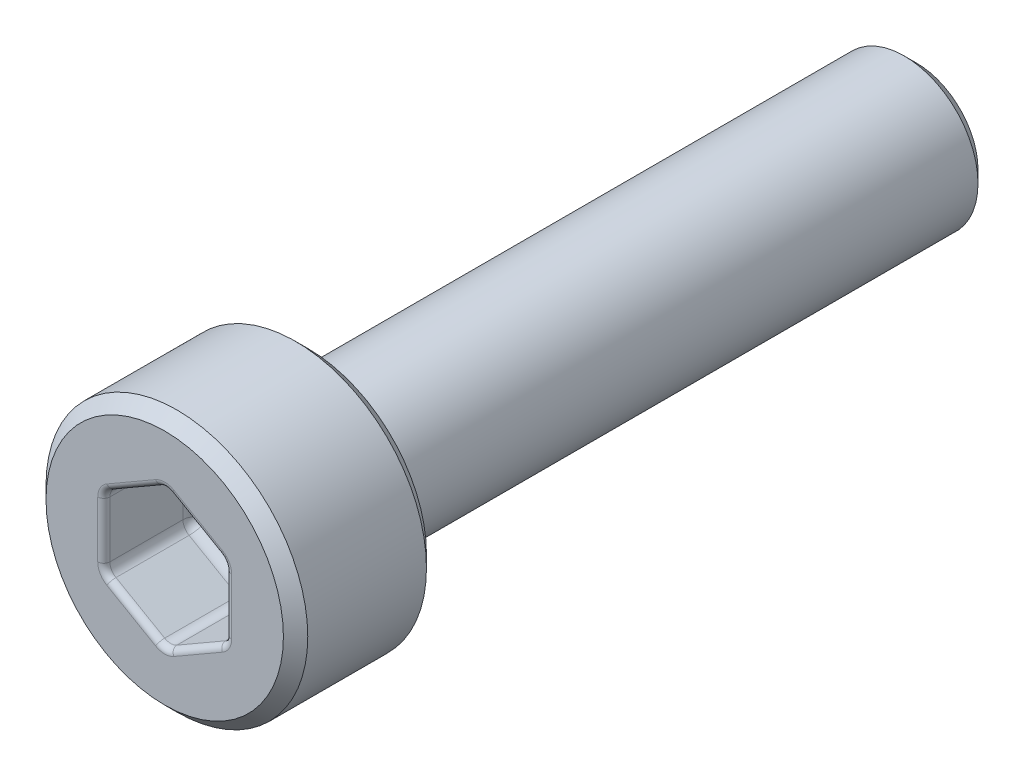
from build123d import *

# Parameters (mm, degrees)
SCHNITT_LINEAR_AUSTRAGEN1_DEPTH = 1.5
FASE1_SIZE                      = 0.2
VERRUNDUNG1_R                   = 0.2
VERRUNDUNG2_R                   = 0.1


with BuildPart() as part:
    # Skizze1 → Rotation1 (revolve)
    with BuildSketch(Plane(origin=(0, 0, 0), x_dir=(0, 0, -1), z_dir=(1, 0, 0)), mode=Mode.PRIVATE) as rotation1_sk:
        Polygon((-2.35, 0), (-2.35, 2.15), (0, 2.15), (0, 1.21), (10, 1.21), (10, 0), align=None)
    revolve(rotation1_sk.sketch.rotate(Axis((0, 0, 21.919879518), (0, 0, -1)), 90), axis=Axis((0, 0, 21.919879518), (0, 0, -1)))

    # Skizze2 → Schnitt-Linear austragen1 (cut)
    with BuildSketch(Plane.XY.offset(2.35)):
        Polygon((1, -0.577350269), (1, 0.577350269), (0, 1.154700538), (-1, 0.577350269), (-1, -0.577350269), (0, -1.154700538), align=None)
    extrude(amount=-SCHNITT_LINEAR_AUSTRAGEN1_DEPTH, mode=Mode.SUBTRACT)

    # Fase1
    fase1_edges = [part.edges().sort_by_distance(p)[0] for p in [
        (-1.21, 0, -10),
        (-2.15, 0, 0),
        (-2.15, 0, 2.35),
    ]]
    chamfer(fase1_edges, length=FASE1_SIZE)

    # Verrundung1
    verrundung1_edges = [part.edges().sort_by_distance(p)[0] for p in [
        (0.5, -0.866025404, 0.85),
        (1, -0.577350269, 1.6),
        (-0.5, -0.866025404, 0.85),
        (0, -1.154700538, 1.6),
        (-1, 0, 0.85),
        (-1, -0.577350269, 1.6),
        (-0.5, 0.866025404, 0.85),
        (-1, 0.577350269, 1.6),
        (0.5, 0.866025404, 0.85),
        (0, 1.154700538, 1.6),
        (1, 0, 0.85),
        (1, 0.577350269, 1.6),
        (-1.21, 0, 0),
    ]]
    fillet(verrundung1_edges, radius=VERRUNDUNG1_R)

    # Verrundung2
    verrundung2_edges = [part.edges().sort_by_distance(p)[0] for p in [
        (-0.5, -0.866025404, 2.35),
        (-1, 0, 2.35),
        (-0.5, 0.866025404, 2.35),
        (0.5, 0.866025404, 2.35),
        (1, 0, 2.35),
        (0.5, -0.866025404, 2.35),
        (-0.973205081, -0.561880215, 2.35),
        (0, -1.123760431, 2.35),
        (0.973205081, -0.561880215, 2.35),
        (0.973205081, 0.561880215, 2.35),
        (0, 1.123760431, 2.35),
        (-0.973205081, 0.561880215, 2.35),
    ]]
    fillet(verrundung2_edges, radius=VERRUNDUNG2_R)


solid = part.part
